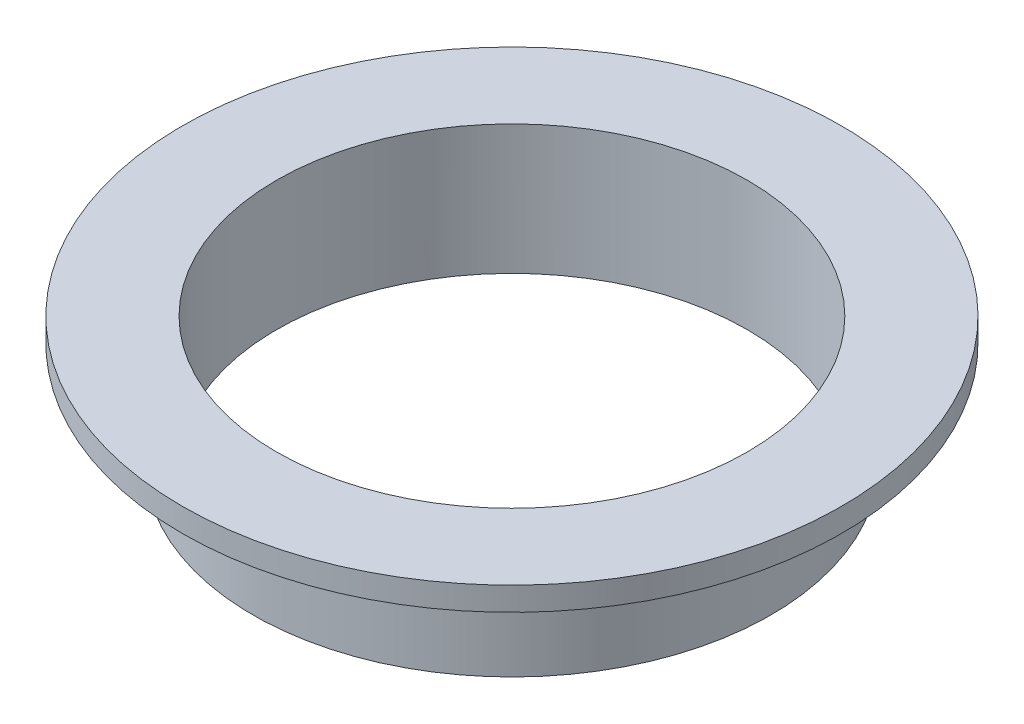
ISO-10303-21;
HEADER;
FILE_DESCRIPTION(('STEP AP214'),'2;1');
FILE_NAME('part.step','',(''),(''),'','','');
FILE_SCHEMA(('AUTOMOTIVE_DESIGN { 1 0 10303 214 1 1 1 1 }'));
ENDSEC;
DATA;
#1=APPLICATION_CONTEXT('core data for automotive mechanical design processes');
#2=APPLICATION_PROTOCOL_DEFINITION('international standard','automotive_design',2000,#1);
#3=PRODUCT_CONTEXT('',#1,'mechanical');
#4=PRODUCT('Part','Part','',(#3));
#5=PRODUCT_RELATED_PRODUCT_CATEGORY('part','',(#4));
#6=PRODUCT_DEFINITION_FORMATION('','',#4);
#7=PRODUCT_DEFINITION_CONTEXT('part definition',#1,'design');
#8=PRODUCT_DEFINITION('design','',#6,#7);
#9=PRODUCT_DEFINITION_SHAPE('','',#8);
#10=(LENGTH_UNIT() NAMED_UNIT(*) SI_UNIT(.MILLI.,.METRE.));
#11=(NAMED_UNIT(*) PLANE_ANGLE_UNIT() SI_UNIT($,.RADIAN.));
#12=(NAMED_UNIT(*) SI_UNIT($,.STERADIAN.) SOLID_ANGLE_UNIT());
#13=UNCERTAINTY_MEASURE_WITH_UNIT(LENGTH_MEASURE(1.E-05),#10,'distance_accuracy_value','');
#14=(GEOMETRIC_REPRESENTATION_CONTEXT(3) GLOBAL_UNCERTAINTY_ASSIGNED_CONTEXT((#13)) GLOBAL_UNIT_ASSIGNED_CONTEXT((#10,
#11,#12)) REPRESENTATION_CONTEXT('',''));
#15=CARTESIAN_POINT('',(0.,0.,0.));
#16=DIRECTION('',(0.,0.,1.));
#17=DIRECTION('',(1.,0.,0.));
#18=AXIS2_PLACEMENT_3D('',#15,#16,#17);
#19=CARTESIAN_POINT('',(0.,2.,0.));
#20=DIRECTION('',(0.,-1.,0.));
#21=DIRECTION('',(0.,0.,-1.));
#22=AXIS2_PLACEMENT_3D('',#19,#20,#21);
#23=CYLINDRICAL_SURFACE('',#22,28.);
#24=CARTESIAN_POINT('',(0.,2.,0.));
#25=DIRECTION('',(0.,1.,0.));
#26=DIRECTION('',(0.,0.,1.));
#27=AXIS2_PLACEMENT_3D('',#24,#25,#26);
#28=CIRCLE('',#27,28.);
#29=CARTESIAN_POINT('',(0.,2.,28.));
#30=VERTEX_POINT('',#29);
#31=EDGE_CURVE('E39',#30,#30,#28,.T.);
#32=ORIENTED_EDGE('',*,*,#31,.F.);
#33=EDGE_LOOP('',(#32));
#34=FACE_BOUND('',#33,.T.);
#35=CARTESIAN_POINT('',(0.,0.,0.));
#36=DIRECTION('',(0.,1.,0.));
#37=DIRECTION('',(0.,0.,1.));
#38=AXIS2_PLACEMENT_3D('',#35,#36,#37);
#39=CIRCLE('',#38,28.);
#40=CARTESIAN_POINT('',(0.,0.,28.));
#41=VERTEX_POINT('',#40);
#42=EDGE_CURVE('E35',#41,#41,#39,.T.);
#43=ORIENTED_EDGE('',*,*,#42,.T.);
#44=EDGE_LOOP('',(#43));
#45=FACE_BOUND('',#44,.T.);
#46=ADVANCED_FACE('F32',(#34,#45),#23,.T.);
#47=CARTESIAN_POINT('',(0.,2.,0.));
#48=DIRECTION('',(0.,1.,0.));
#49=DIRECTION('',(0.,0.,1.));
#50=AXIS2_PLACEMENT_3D('',#47,#48,#49);
#51=PLANE('',#50);
#52=CARTESIAN_POINT('',(0.,2.,0.));
#53=DIRECTION('',(0.,1.,0.));
#54=DIRECTION('',(0.,0.,1.));
#55=AXIS2_PLACEMENT_3D('',#52,#53,#54);
#56=CIRCLE('',#55,20.);
#57=CARTESIAN_POINT('',(0.,2.,20.));
#58=VERTEX_POINT('',#57);
#59=EDGE_CURVE('E48',#58,#58,#56,.T.);
#60=ORIENTED_EDGE('',*,*,#59,.F.);
#61=EDGE_LOOP('',(#60));
#62=FACE_BOUND('',#61,.T.);
#63=ORIENTED_EDGE('',*,*,#31,.T.);
#64=EDGE_LOOP('',(#63));
#65=FACE_BOUND('',#64,.T.);
#66=ADVANCED_FACE('F70',(#62,#65),#51,.T.);
#67=CARTESIAN_POINT('',(0.,0.,0.));
#68=DIRECTION('',(0.,1.,0.));
#69=DIRECTION('',(0.,0.,1.));
#70=AXIS2_PLACEMENT_3D('',#67,#68,#69);
#71=PLANE('',#70);
#72=CARTESIAN_POINT('',(0.,0.,0.));
#73=DIRECTION('',(0.,-1.,0.));
#74=DIRECTION('',(0.,0.,-1.));
#75=AXIS2_PLACEMENT_3D('',#72,#73,#74);
#76=CIRCLE('',#75,22.);
#77=CARTESIAN_POINT('',(0.,0.,-22.));
#78=VERTEX_POINT('',#77);
#79=EDGE_CURVE('E10',#78,#78,#76,.T.);
#80=ORIENTED_EDGE('',*,*,#79,.F.);
#81=EDGE_LOOP('',(#80));
#82=FACE_BOUND('',#81,.T.);
#83=ORIENTED_EDGE('',*,*,#42,.F.);
#84=EDGE_LOOP('',(#83));
#85=FACE_BOUND('',#84,.T.);
#86=ADVANCED_FACE('F65',(#82,#85),#71,.F.);
#87=CARTESIAN_POINT('',(0.,-9.,0.));
#88=DIRECTION('',(0.,1.,0.));
#89=DIRECTION('',(0.,0.,1.));
#90=AXIS2_PLACEMENT_3D('',#87,#88,#89);
#91=CYLINDRICAL_SURFACE('',#90,22.);
#92=CARTESIAN_POINT('',(0.,-9.,0.));
#93=DIRECTION('',(0.,-1.,0.));
#94=DIRECTION('',(0.,0.,-1.));
#95=AXIS2_PLACEMENT_3D('',#92,#93,#94);
#96=CIRCLE('',#95,22.);
#97=CARTESIAN_POINT('',(0.,-9.,-22.));
#98=VERTEX_POINT('',#97);
#99=EDGE_CURVE('E45',#98,#98,#96,.T.);
#100=ORIENTED_EDGE('',*,*,#99,.F.);
#101=EDGE_LOOP('',(#100));
#102=FACE_BOUND('',#101,.T.);
#103=ORIENTED_EDGE('',*,*,#79,.T.);
#104=EDGE_LOOP('',(#103));
#105=FACE_BOUND('',#104,.T.);
#106=ADVANCED_FACE('F60',(#102,#105),#91,.T.);
#107=CARTESIAN_POINT('',(0.,-9.,0.));
#108=DIRECTION('',(0.,-1.,0.));
#109=DIRECTION('',(0.,0.,-1.));
#110=AXIS2_PLACEMENT_3D('',#107,#108,#109);
#111=PLANE('',#110);
#112=CARTESIAN_POINT('',(0.,-9.,0.));
#113=DIRECTION('',(0.,-1.,0.));
#114=DIRECTION('',(0.,0.,-1.));
#115=AXIS2_PLACEMENT_3D('',#112,#113,#114);
#116=CIRCLE('',#115,20.);
#117=CARTESIAN_POINT('',(0.,-9.,-20.));
#118=VERTEX_POINT('',#117);
#119=EDGE_CURVE('E51',#118,#118,#116,.T.);
#120=ORIENTED_EDGE('',*,*,#119,.F.);
#121=EDGE_LOOP('',(#120));
#122=FACE_BOUND('',#121,.T.);
#123=ORIENTED_EDGE('',*,*,#99,.T.);
#124=EDGE_LOOP('',(#123));
#125=FACE_BOUND('',#124,.T.);
#126=ADVANCED_FACE('F57',(#122,#125),#111,.T.);
#127=CARTESIAN_POINT('',(0.,27.,0.));
#128=DIRECTION('',(0.,-1.,0.));
#129=DIRECTION('',(0.,0.,-1.));
#130=AXIS2_PLACEMENT_3D('',#127,#128,#129);
#131=CYLINDRICAL_SURFACE('',#130,20.);
#132=ORIENTED_EDGE('',*,*,#59,.T.);
#133=EDGE_LOOP('',(#132));
#134=FACE_BOUND('',#133,.T.);
#135=ORIENTED_EDGE('',*,*,#119,.T.);
#136=EDGE_LOOP('',(#135));
#137=FACE_BOUND('',#136,.T.);
#138=ADVANCED_FACE('F55',(#134,#137),#131,.F.);
#139=CLOSED_SHELL('',(#46,#66,#86,#106,#126,#138));
#140=MANIFOLD_SOLID_BREP('B2',#139);
#141=ADVANCED_BREP_SHAPE_REPRESENTATION('',(#18,#140),#14);
#142=SHAPE_DEFINITION_REPRESENTATION(#9,#141);
ENDSEC;
END-ISO-10303-21;
